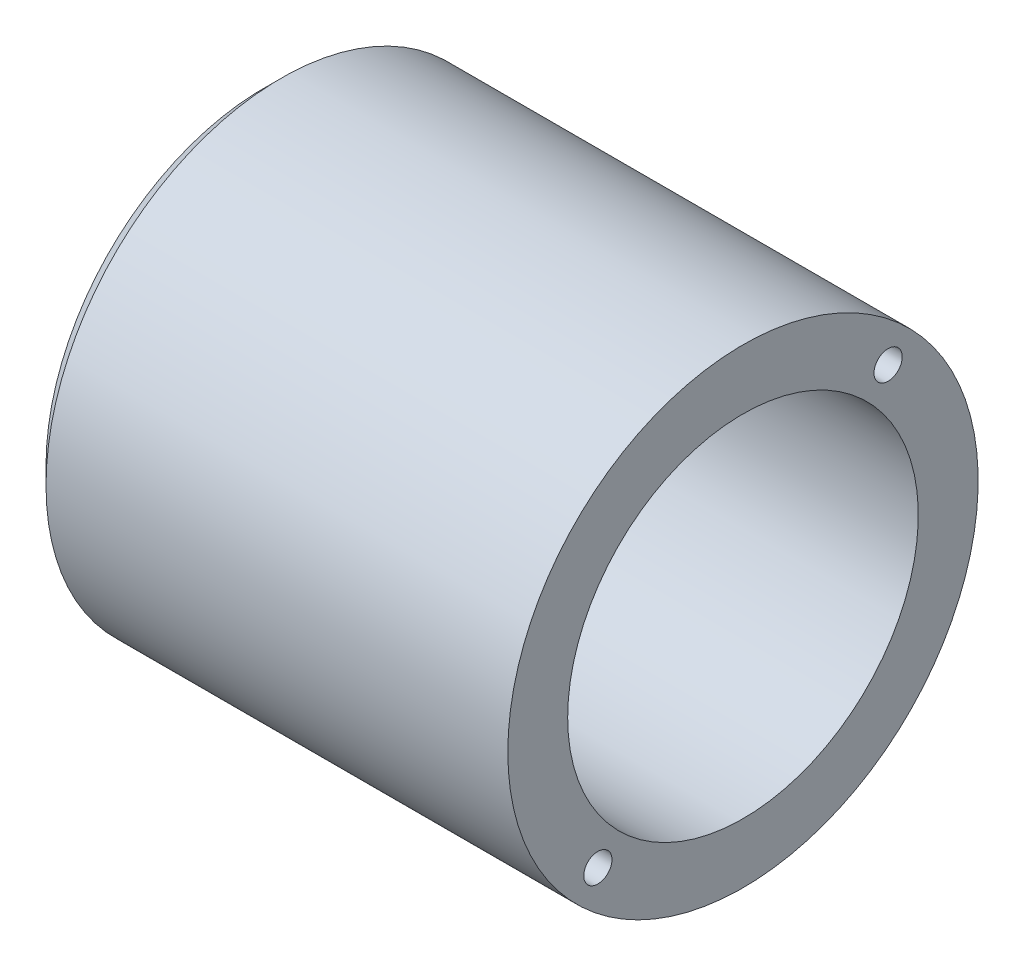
ISO-10303-21;
HEADER;
FILE_DESCRIPTION(('STEP AP214'),'2;1');
FILE_NAME('part.step','',(''),(''),'','','');
FILE_SCHEMA(('AUTOMOTIVE_DESIGN { 1 0 10303 214 1 1 1 1 }'));
ENDSEC;
DATA;
#1=APPLICATION_CONTEXT('core data for automotive mechanical design processes');
#2=APPLICATION_PROTOCOL_DEFINITION('international standard','automotive_design',2000,#1);
#3=PRODUCT_CONTEXT('',#1,'mechanical');
#4=PRODUCT('Part','Part','',(#3));
#5=PRODUCT_RELATED_PRODUCT_CATEGORY('part','',(#4));
#6=PRODUCT_DEFINITION_FORMATION('','',#4);
#7=PRODUCT_DEFINITION_CONTEXT('part definition',#1,'design');
#8=PRODUCT_DEFINITION('design','',#6,#7);
#9=PRODUCT_DEFINITION_SHAPE('','',#8);
#10=(LENGTH_UNIT() NAMED_UNIT(*) SI_UNIT(.MILLI.,.METRE.));
#11=(NAMED_UNIT(*) PLANE_ANGLE_UNIT() SI_UNIT($,.RADIAN.));
#12=(NAMED_UNIT(*) SI_UNIT($,.STERADIAN.) SOLID_ANGLE_UNIT());
#13=UNCERTAINTY_MEASURE_WITH_UNIT(LENGTH_MEASURE(1.E-05),#10,'distance_accuracy_value','');
#14=(GEOMETRIC_REPRESENTATION_CONTEXT(3) GLOBAL_UNCERTAINTY_ASSIGNED_CONTEXT((#13)) GLOBAL_UNIT_ASSIGNED_CONTEXT((#10,
#11,#12)) REPRESENTATION_CONTEXT('',''));
#15=CARTESIAN_POINT('',(0.,0.,0.));
#16=DIRECTION('',(0.,0.,1.));
#17=DIRECTION('',(1.,0.,0.));
#18=AXIS2_PLACEMENT_3D('',#15,#16,#17);
#19=CARTESIAN_POINT('',(-8.3,0.,0.));
#20=DIRECTION('',(1.,0.,0.));
#21=DIRECTION('',(0.,0.,-1.));
#22=AXIS2_PLACEMENT_3D('',#19,#20,#21);
#23=PLANE('',#22);
#24=CARTESIAN_POINT('',(-8.3,0.,0.));
#25=DIRECTION('',(1.,0.,0.));
#26=DIRECTION('',(0.,0.,-1.));
#27=AXIS2_PLACEMENT_3D('',#24,#25,#26);
#28=CIRCLE('',#27,25.4999999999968);
#29=CARTESIAN_POINT('',(-8.3,0.,-25.4999999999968));
#30=VERTEX_POINT('',#29);
#31=EDGE_CURVE('E50',#30,#30,#28,.F.);
#32=ORIENTED_EDGE('',*,*,#31,.T.);
#33=EDGE_LOOP('',(#32));
#34=FACE_BOUND('',#33,.T.);
#35=ADVANCED_FACE('F42',(#34),#23,.F.);
#36=CARTESIAN_POINT('',(-200068.176472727,0.,0.));
#37=DIRECTION('',(-1.,0.,0.));
#38=DIRECTION('',(0.,0.,1.));
#39=AXIS2_PLACEMENT_3D('',#36,#37,#38);
#40=CYLINDRICAL_SURFACE('',#39,27.5);
#41=CARTESIAN_POINT('',(-6.30000000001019,0.,0.));
#42=DIRECTION('',(1.,0.,0.));
#43=DIRECTION('',(0.,0.,-1.));
#44=AXIS2_PLACEMENT_3D('',#41,#42,#43);
#45=CIRCLE('',#44,27.5);
#46=CARTESIAN_POINT('',(-6.30000000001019,0.,-27.5));
#47=VERTEX_POINT('',#46);
#48=EDGE_CURVE('E11',#47,#47,#45,.T.);
#49=ORIENTED_EDGE('',*,*,#48,.T.);
#50=EDGE_LOOP('',(#49));
#51=FACE_BOUND('',#50,.T.);
#52=CARTESIAN_POINT('',(47.6999999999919,0.,0.));
#53=DIRECTION('',(-1.,0.,0.));
#54=DIRECTION('',(0.,0.,1.));
#55=AXIS2_PLACEMENT_3D('',#52,#53,#54);
#56=CIRCLE('',#55,27.5);
#57=CARTESIAN_POINT('',(47.6999999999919,0.,27.5));
#58=VERTEX_POINT('',#57);
#59=EDGE_CURVE('E87',#58,#58,#56,.T.);
#60=ORIENTED_EDGE('',*,*,#59,.T.);
#61=EDGE_LOOP('',(#60));
#62=FACE_BOUND('',#61,.T.);
#63=ADVANCED_FACE('F108',(#51,#62),#40,.T.);
#64=CARTESIAN_POINT('',(47.7,20.5,0.));
#65=DIRECTION('',(-1.,0.,0.));
#66=DIRECTION('',(0.,0.,1.));
#67=AXIS2_PLACEMENT_3D('',#64,#65,#66);
#68=PLANE('',#67);
#69=CARTESIAN_POINT('',(47.7,-16.9705627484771,16.9705627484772));
#70=DIRECTION('',(1.,0.,0.));
#71=DIRECTION('',(0.,0.,-1.));
#72=AXIS2_PLACEMENT_3D('',#69,#70,#71);
#73=CIRCLE('',#72,1.65);
#74=CARTESIAN_POINT('',(47.7,-16.9705627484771,15.3205627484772));
#75=VERTEX_POINT('',#74);
#76=EDGE_CURVE('E69',#75,#75,#73,.T.);
#77=ORIENTED_EDGE('',*,*,#76,.F.);
#78=EDGE_LOOP('',(#77));
#79=FACE_BOUND('',#78,.T.);
#80=CARTESIAN_POINT('',(47.7,16.9705627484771,-16.9705627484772));
#81=DIRECTION('',(1.,0.,0.));
#82=DIRECTION('',(0.,0.,-1.));
#83=AXIS2_PLACEMENT_3D('',#80,#81,#82);
#84=CIRCLE('',#83,1.65);
#85=CARTESIAN_POINT('',(47.7,16.9705627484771,-18.6205627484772));
#86=VERTEX_POINT('',#85);
#87=EDGE_CURVE('E68',#86,#86,#84,.T.);
#88=ORIENTED_EDGE('',*,*,#87,.F.);
#89=EDGE_LOOP('',(#88));
#90=FACE_BOUND('',#89,.T.);
#91=ORIENTED_EDGE('',*,*,#59,.F.);
#92=EDGE_LOOP('',(#91));
#93=FACE_BOUND('',#92,.T.);
#94=CARTESIAN_POINT('',(47.6999999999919,0.,0.));
#95=DIRECTION('',(-1.,0.,0.));
#96=DIRECTION('',(0.,0.,1.));
#97=AXIS2_PLACEMENT_3D('',#94,#95,#96);
#98=CIRCLE('',#97,20.5);
#99=CARTESIAN_POINT('',(47.6999999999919,0.,20.5));
#100=VERTEX_POINT('',#99);
#101=EDGE_CURVE('E83',#100,#100,#98,.T.);
#102=ORIENTED_EDGE('',*,*,#101,.T.);
#103=EDGE_LOOP('',(#102));
#104=FACE_BOUND('',#103,.T.);
#105=ADVANCED_FACE('F112',(#79,#90,#93,#104),#68,.F.);
#106=CARTESIAN_POINT('',(-200068.176472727,0.,0.));
#107=DIRECTION('',(-1.,0.,0.));
#108=DIRECTION('',(0.,0.,1.));
#109=AXIS2_PLACEMENT_3D('',#106,#107,#108);
#110=CYLINDRICAL_SURFACE('',#109,20.5);
#111=ORIENTED_EDGE('',*,*,#101,.F.);
#112=EDGE_LOOP('',(#111));
#113=FACE_BOUND('',#112,.T.);
#114=CARTESIAN_POINT('',(-3.29999999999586,0.,0.));
#115=DIRECTION('',(-1.,0.,0.));
#116=DIRECTION('',(0.,0.,1.));
#117=AXIS2_PLACEMENT_3D('',#114,#115,#116);
#118=CIRCLE('',#117,20.5);
#119=CARTESIAN_POINT('',(-3.29999999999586,0.,20.5));
#120=VERTEX_POINT('',#119);
#121=EDGE_CURVE('E80',#120,#120,#118,.T.);
#122=ORIENTED_EDGE('',*,*,#121,.T.);
#123=EDGE_LOOP('',(#122));
#124=FACE_BOUND('',#123,.T.);
#125=ADVANCED_FACE('F103',(#113,#124),#110,.F.);
#126=CARTESIAN_POINT('',(-3.3,20.5,0.));
#127=DIRECTION('',(-1.,0.,0.));
#128=DIRECTION('',(0.,0.,1.));
#129=AXIS2_PLACEMENT_3D('',#126,#127,#128);
#130=PLANE('',#129);
#131=ORIENTED_EDGE('',*,*,#121,.F.);
#132=EDGE_LOOP('',(#131));
#133=FACE_BOUND('',#132,.T.);
#134=ADVANCED_FACE('F96',(#133),#130,.F.);
#135=CARTESIAN_POINT('',(-8.29999999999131,0.,0.));
#136=DIRECTION('',(1.,0.,0.));
#137=DIRECTION('',(0.,0.,-1.));
#138=AXIS2_PLACEMENT_3D('',#135,#136,#137);
#139=CONICAL_SURFACE('',#138,25.5000000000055,0.78539816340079);
#140=ORIENTED_EDGE('',*,*,#48,.F.);
#141=EDGE_LOOP('',(#140));
#142=FACE_BOUND('',#141,.T.);
#143=ORIENTED_EDGE('',*,*,#31,.F.);
#144=EDGE_LOOP('',(#143));
#145=FACE_BOUND('',#144,.T.);
#146=ADVANCED_FACE('F44',(#142,#145),#139,.T.);
#147=CARTESIAN_POINT('',(39.2,16.9705627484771,-16.9705627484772));
#148=DIRECTION('',(1.,0.,0.));
#149=DIRECTION('',(0.,0.,-1.));
#150=AXIS2_PLACEMENT_3D('',#147,#148,#149);
#151=CONICAL_SURFACE('',#150,1.65,1.02974425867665);
#152=CARTESIAN_POINT('',(38.2085799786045,16.9705627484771,-16.9705627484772));
#153=VERTEX_POINT('',#152);
#154=VERTEX_LOOP('',#153);
#155=FACE_BOUND('',#154,.T.);
#156=CARTESIAN_POINT('',(39.2,16.9705627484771,-16.9705627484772));
#157=DIRECTION('',(1.,0.,0.));
#158=DIRECTION('',(0.,0.,-1.));
#159=AXIS2_PLACEMENT_3D('',#156,#157,#158);
#160=CIRCLE('',#159,1.65);
#161=CARTESIAN_POINT('',(39.2,16.9705627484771,-18.6205627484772));
#162=VERTEX_POINT('',#161);
#163=EDGE_CURVE('E73',#162,#162,#160,.T.);
#164=ORIENTED_EDGE('',*,*,#163,.T.);
#165=EDGE_LOOP('',(#164));
#166=FACE_BOUND('',#165,.T.);
#167=ADVANCED_FACE('F95',(#155,#166),#151,.F.);
#168=CARTESIAN_POINT('',(47.7,16.9705627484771,-16.9705627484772));
#169=DIRECTION('',(1.,0.,0.));
#170=DIRECTION('',(0.,0.,-1.));
#171=AXIS2_PLACEMENT_3D('',#168,#169,#170);
#172=CYLINDRICAL_SURFACE('',#171,1.65);
#173=ORIENTED_EDGE('',*,*,#163,.F.);
#174=EDGE_LOOP('',(#173));
#175=FACE_BOUND('',#174,.T.);
#176=ORIENTED_EDGE('',*,*,#87,.T.);
#177=EDGE_LOOP('',(#176));
#178=FACE_BOUND('',#177,.T.);
#179=ADVANCED_FACE('F61',(#175,#178),#172,.F.);
#180=CARTESIAN_POINT('',(39.2,-16.9705627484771,16.9705627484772));
#181=DIRECTION('',(1.,0.,0.));
#182=DIRECTION('',(0.,0.,-1.));
#183=AXIS2_PLACEMENT_3D('',#180,#181,#182);
#184=CONICAL_SURFACE('',#183,1.65,1.02974425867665);
#185=CARTESIAN_POINT('',(38.2085799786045,-16.9705627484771,16.9705627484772));
#186=VERTEX_POINT('',#185);
#187=VERTEX_LOOP('',#186);
#188=FACE_BOUND('',#187,.T.);
#189=CARTESIAN_POINT('',(39.2,-16.9705627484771,16.9705627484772));
#190=DIRECTION('',(1.,0.,0.));
#191=DIRECTION('',(0.,0.,-1.));
#192=AXIS2_PLACEMENT_3D('',#189,#190,#191);
#193=CIRCLE('',#192,1.65);
#194=CARTESIAN_POINT('',(39.2,-16.9705627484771,15.3205627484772));
#195=VERTEX_POINT('',#194);
#196=EDGE_CURVE('E65',#195,#195,#193,.T.);
#197=ORIENTED_EDGE('',*,*,#196,.T.);
#198=EDGE_LOOP('',(#197));
#199=FACE_BOUND('',#198,.T.);
#200=ADVANCED_FACE('F57',(#188,#199),#184,.F.);
#201=CARTESIAN_POINT('',(47.7,-16.9705627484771,16.9705627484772));
#202=DIRECTION('',(1.,0.,0.));
#203=DIRECTION('',(0.,0.,-1.));
#204=AXIS2_PLACEMENT_3D('',#201,#202,#203);
#205=CYLINDRICAL_SURFACE('',#204,1.65);
#206=ORIENTED_EDGE('',*,*,#196,.F.);
#207=EDGE_LOOP('',(#206));
#208=FACE_BOUND('',#207,.T.);
#209=ORIENTED_EDGE('',*,*,#76,.T.);
#210=EDGE_LOOP('',(#209));
#211=FACE_BOUND('',#210,.T.);
#212=ADVANCED_FACE('F60',(#208,#211),#205,.F.);
#213=CLOSED_SHELL('',(#35,#63,#105,#125,#134,#146,#167,#179,#200,#212));
#214=MANIFOLD_SOLID_BREP('B2',#213);
#215=ADVANCED_BREP_SHAPE_REPRESENTATION('',(#18,#214),#14);
#216=SHAPE_DEFINITION_REPRESENTATION(#9,#215);
ENDSEC;
END-ISO-10303-21;
